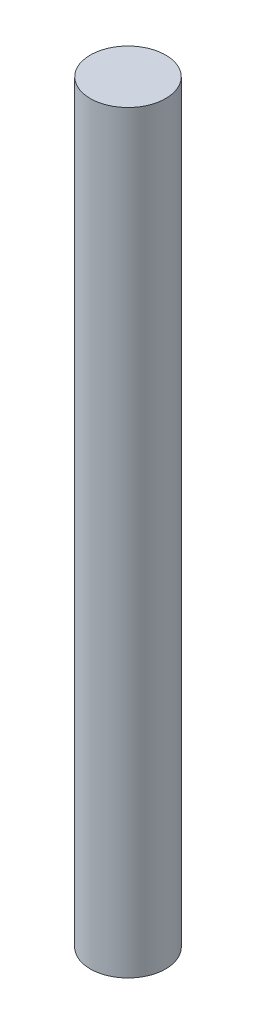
from build123d import *

# Parameters (mm, degrees)
SZKIC1_R                    = 25
DODANIE_WYCI_GNI_CIE1_DEPTH = 500


with BuildPart() as part:
    # Szkic1 → Dodanie-wyci_gni_cie1 (new body)
    with BuildSketch(Plane(origin=(0, 0, 0), x_dir=(1, 0, 0), z_dir=(0, 1, 0))):
        with Locations(Location((0, 0, 0), (0, 0, 270))):
            Circle(SZKIC1_R)
    extrude(amount=DODANIE_WYCI_GNI_CIE1_DEPTH)


solid = part.part
